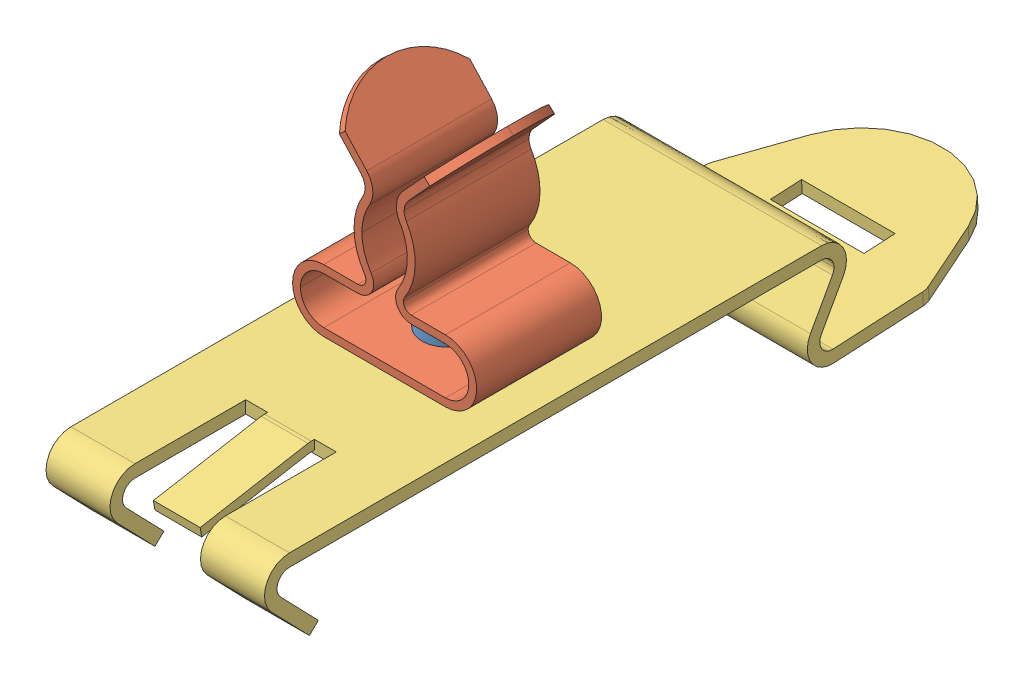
SolidWorks assembly 36244.SLDASM, configuration Default (file format 8000). Lengths in mm.
Overall size (14 20.47 50.45).
3 component instances, 3 part files, 0 mates.
Components (placement in the parent):
- 36244_01-1: 36244_01.SLDPRT [Default] at origin size (6 3.3 6)
- 36244_02-1: 36244_02.SLDPRT [Default] at origin size (11.8 13.57 8)
- 36244_03-1: 36244_03.SLDPRT [Default] at origin size (14 6.91 50.45)
